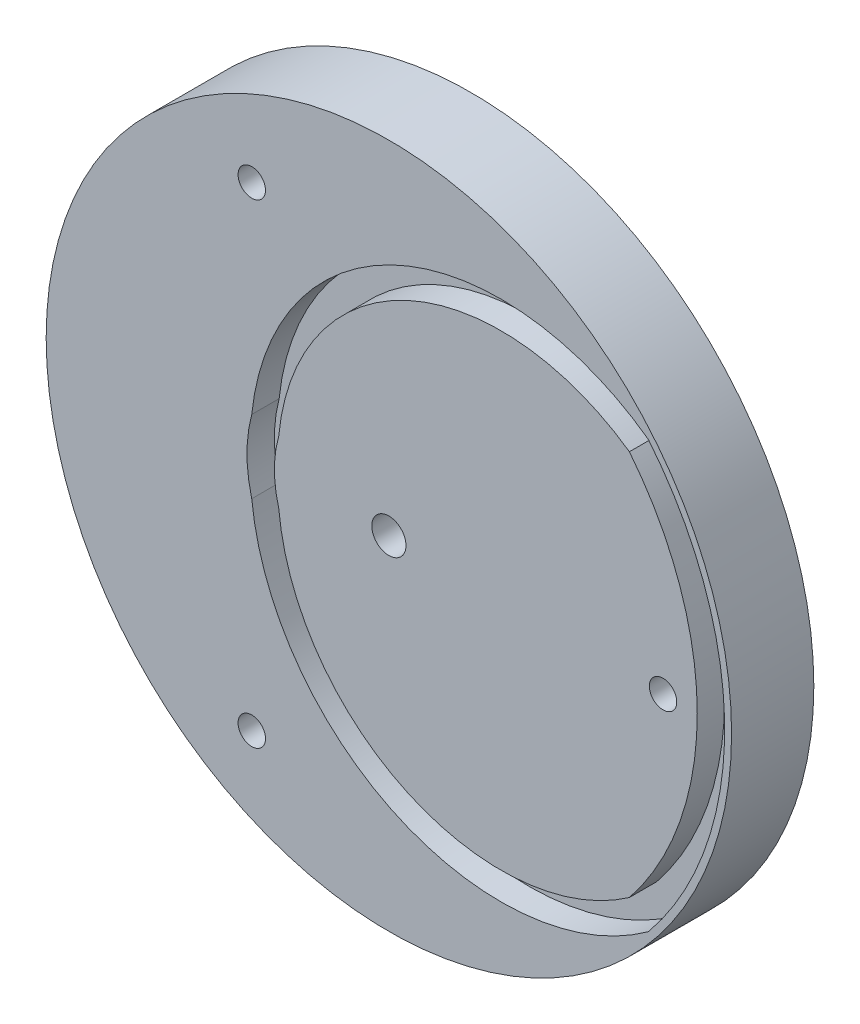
ISO-10303-21;
HEADER;
FILE_DESCRIPTION(('STEP AP214'),'2;1');
FILE_NAME('part.step','',(''),(''),'','','');
FILE_SCHEMA(('AUTOMOTIVE_DESIGN { 1 0 10303 214 1 1 1 1 }'));
ENDSEC;
DATA;
#1=APPLICATION_CONTEXT('core data for automotive mechanical design processes');
#2=APPLICATION_PROTOCOL_DEFINITION('international standard','automotive_design',2000,#1);
#3=PRODUCT_CONTEXT('',#1,'mechanical');
#4=PRODUCT('Part','Part','',(#3));
#5=PRODUCT_RELATED_PRODUCT_CATEGORY('part','',(#4));
#6=PRODUCT_DEFINITION_FORMATION('','',#4);
#7=PRODUCT_DEFINITION_CONTEXT('part definition',#1,'design');
#8=PRODUCT_DEFINITION('design','',#6,#7);
#9=PRODUCT_DEFINITION_SHAPE('','',#8);
#10=(LENGTH_UNIT() NAMED_UNIT(*) SI_UNIT(.MILLI.,.METRE.));
#11=(NAMED_UNIT(*) PLANE_ANGLE_UNIT() SI_UNIT($,.RADIAN.));
#12=(NAMED_UNIT(*) SI_UNIT($,.STERADIAN.) SOLID_ANGLE_UNIT());
#13=UNCERTAINTY_MEASURE_WITH_UNIT(LENGTH_MEASURE(1.E-05),#10,'distance_accuracy_value','');
#14=(GEOMETRIC_REPRESENTATION_CONTEXT(3) GLOBAL_UNCERTAINTY_ASSIGNED_CONTEXT((#13)) GLOBAL_UNIT_ASSIGNED_CONTEXT((#10,
#11,#12)) REPRESENTATION_CONTEXT('',''));
#15=CARTESIAN_POINT('',(0.,0.,0.));
#16=DIRECTION('',(0.,0.,1.));
#17=DIRECTION('',(1.,0.,0.));
#18=AXIS2_PLACEMENT_3D('',#15,#16,#17);
#19=CARTESIAN_POINT('',(0.,0.,0.));
#20=DIRECTION('',(0.,0.,1.));
#21=DIRECTION('',(1.,0.,0.));
#22=AXIS2_PLACEMENT_3D('',#19,#20,#21);
#23=PLANE('',#22);
#24=CARTESIAN_POINT('',(63.5,0.,0.));
#25=DIRECTION('',(0.,0.,1.));
#26=DIRECTION('',(1.,0.,0.));
#27=AXIS2_PLACEMENT_3D('',#24,#25,#26);
#28=CIRCLE('',#27,3.175);
#29=CARTESIAN_POINT('',(66.675,0.,0.));
#30=VERTEX_POINT('',#29);
#31=EDGE_CURVE('E271',#30,#30,#28,.T.);
#32=ORIENTED_EDGE('',*,*,#31,.F.);
#33=EDGE_LOOP('',(#32));
#34=FACE_BOUND('',#33,.T.);
#35=CARTESIAN_POINT('',(0.,0.,0.));
#36=DIRECTION('',(0.,0.,1.));
#37=DIRECTION('',(1.,0.,0.));
#38=AXIS2_PLACEMENT_3D('',#35,#36,#37);
#39=CIRCLE('',#38,3.9624);
#40=CARTESIAN_POINT('',(3.9624,0.,0.));
#41=VERTEX_POINT('',#40);
#42=EDGE_CURVE('E277',#41,#41,#39,.T.);
#43=ORIENTED_EDGE('',*,*,#42,.F.);
#44=EDGE_LOOP('',(#43));
#45=FACE_BOUND('',#44,.T.);
#46=CARTESIAN_POINT('',(0.,0.,0.));
#47=DIRECTION('',(0.,0.,1.));
#48=DIRECTION('',(1.,0.,0.));
#49=AXIS2_PLACEMENT_3D('',#46,#47,#48);
#50=CIRCLE('',#49,26.5182738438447);
#51=CARTESIAN_POINT('',(-25.4973153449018,7.28736974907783,0.));
#52=VERTEX_POINT('',#51);
#53=CARTESIAN_POINT('',(-25.4973153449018,-7.28736974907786,0.));
#54=VERTEX_POINT('',#53);
#55=EDGE_CURVE('E68',#52,#54,#50,.T.);
#56=ORIENTED_EDGE('',*,*,#55,.T.);
#57=CARTESIAN_POINT('',(25.9656012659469,-2.42204576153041,0.));
#58=DIRECTION('',(0.,0.,-1.));
#59=DIRECTION('',(-1.,0.,0.));
#60=AXIS2_PLACEMENT_3D('',#57,#58,#59);
#61=CIRCLE('',#60,51.6923898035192);
#62=CARTESIAN_POINT('',(55.7057618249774,-44.702372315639,0.));
#63=VERTEX_POINT('',#62);
#64=EDGE_CURVE('E140',#63,#54,#61,.T.);
#65=ORIENTED_EDGE('',*,*,#64,.F.);
#66=CARTESIAN_POINT('',(0.,0.,0.));
#67=DIRECTION('',(0.,0.,-1.));
#68=DIRECTION('',(-1.,0.,0.));
#69=AXIS2_PLACEMENT_3D('',#66,#67,#68);
#70=CIRCLE('',#69,71.4243235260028);
#71=CARTESIAN_POINT('',(55.7057618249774,44.7023723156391,0.));
#72=VERTEX_POINT('',#71);
#73=EDGE_CURVE('E123',#72,#63,#70,.T.);
#74=ORIENTED_EDGE('',*,*,#73,.F.);
#75=CARTESIAN_POINT('',(25.9656012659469,2.42204576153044,0.));
#76=DIRECTION('',(0.,0.,1.));
#77=DIRECTION('',(1.,0.,0.));
#78=AXIS2_PLACEMENT_3D('',#75,#76,#77);
#79=CIRCLE('',#78,51.6923898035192);
#80=EDGE_CURVE('E93',#72,#52,#79,.T.);
#81=ORIENTED_EDGE('',*,*,#80,.T.);
#82=EDGE_LOOP('',(#56,#65,#74,#81));
#83=FACE_BOUND('',#82,.T.);
#84=ADVANCED_FACE('F35',(#34,#45,#83),#23,.T.);
#85=CARTESIAN_POINT('',(-31.7499999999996,-54.9926131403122,0.));
#86=DIRECTION('',(0.,0.,1.));
#87=DIRECTION('',(-0.499999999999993,-0.866025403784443,0.));
#88=AXIS2_PLACEMENT_3D('',#85,#86,#87);
#89=CIRCLE('',#88,3.175);
#90=CARTESIAN_POINT('',(-33.3374999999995,-57.7422437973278,0.));
#91=VERTEX_POINT('',#90);
#92=EDGE_CURVE('E261',#91,#91,#89,.T.);
#93=ORIENTED_EDGE('',*,*,#92,.F.);
#94=EDGE_LOOP('',(#93));
#95=FACE_BOUND('',#94,.T.);
#96=CARTESIAN_POINT('',(-31.7500000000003,54.9926131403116,0.));
#97=DIRECTION('',(0.,0.,1.));
#98=DIRECTION('',(-0.500000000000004,0.866025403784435,0.));
#99=AXIS2_PLACEMENT_3D('',#96,#97,#98);
#100=CIRCLE('',#99,3.175);
#101=CARTESIAN_POINT('',(-33.3375000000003,57.7422437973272,0.));
#102=VERTEX_POINT('',#101);
#103=EDGE_CURVE('E263',#102,#102,#100,.T.);
#104=ORIENTED_EDGE('',*,*,#103,.F.);
#105=EDGE_LOOP('',(#104));
#106=FACE_BOUND('',#105,.T.);
#107=CARTESIAN_POINT('',(25.9656012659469,-2.42204576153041,0.));
#108=DIRECTION('',(0.,0.,-1.));
#109=DIRECTION('',(-1.,0.,0.));
#110=AXIS2_PLACEMENT_3D('',#107,#108,#109);
#111=CIRCLE('',#110,58.042300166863);
#112=CARTESIAN_POINT('',(60.0961989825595,-49.3689403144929,0.));
#113=VERTEX_POINT('',#112);
#114=CARTESIAN_POINT('',(-31.76258047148,-8.45243894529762,0.));
#115=VERTEX_POINT('',#114);
#116=EDGE_CURVE('E148',#113,#115,#111,.T.);
#117=ORIENTED_EDGE('',*,*,#116,.T.);
#118=CARTESIAN_POINT('',(0.,0.,0.));
#119=DIRECTION('',(0.,0.,1.));
#120=DIRECTION('',(1.,0.,0.));
#121=AXIS2_PLACEMENT_3D('',#118,#119,#120);
#122=CIRCLE('',#121,32.8679972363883);
#123=CARTESIAN_POINT('',(-31.7625804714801,8.45243894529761,0.));
#124=VERTEX_POINT('',#123);
#125=EDGE_CURVE('E187',#124,#115,#122,.T.);
#126=ORIENTED_EDGE('',*,*,#125,.F.);
#127=CARTESIAN_POINT('',(25.9656012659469,2.42204576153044,0.));
#128=DIRECTION('',(0.,0.,1.));
#129=DIRECTION('',(1.,0.,0.));
#130=AXIS2_PLACEMENT_3D('',#127,#128,#129);
#131=CIRCLE('',#130,58.042300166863);
#132=CARTESIAN_POINT('',(60.0961989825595,49.368940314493,0.));
#133=VERTEX_POINT('',#132);
#134=EDGE_CURVE('E168',#133,#124,#131,.T.);
#135=ORIENTED_EDGE('',*,*,#134,.F.);
#136=CARTESIAN_POINT('',(0.,0.,0.));
#137=DIRECTION('',(0.,0.,-1.));
#138=DIRECTION('',(-1.,0.,0.));
#139=AXIS2_PLACEMENT_3D('',#136,#137,#138);
#140=CIRCLE('',#139,77.7743235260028);
#141=EDGE_CURVE('E170',#133,#113,#140,.T.);
#142=ORIENTED_EDGE('',*,*,#141,.T.);
#143=EDGE_LOOP('',(#117,#126,#135,#142));
#144=FACE_BOUND('',#143,.T.);
#145=CARTESIAN_POINT('',(0.,0.,0.));
#146=DIRECTION('',(0.,0.,1.));
#147=DIRECTION('',(1.,0.,0.));
#148=AXIS2_PLACEMENT_3D('',#145,#146,#147);
#149=CIRCLE('',#148,79.375);
#150=CARTESIAN_POINT('',(79.3750000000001,0.,0.));
#151=VERTEX_POINT('',#150);
#152=EDGE_CURVE('E44',#151,#151,#149,.T.);
#153=ORIENTED_EDGE('',*,*,#152,.T.);
#154=EDGE_LOOP('',(#153));
#155=FACE_BOUND('',#154,.T.);
#156=ADVANCED_FACE('F192',(#95,#106,#144,#155),#23,.T.);
#157=CARTESIAN_POINT('',(0.,0.,-19.05));
#158=DIRECTION('',(0.,0.,1.));
#159=DIRECTION('',(1.,0.,0.));
#160=AXIS2_PLACEMENT_3D('',#157,#158,#159);
#161=CYLINDRICAL_SURFACE('',#160,79.375);
#162=CARTESIAN_POINT('',(0.,0.,-19.05));
#163=DIRECTION('',(0.,0.,1.));
#164=DIRECTION('',(1.,0.,0.));
#165=AXIS2_PLACEMENT_3D('',#162,#163,#164);
#166=CIRCLE('',#165,79.375);
#167=CARTESIAN_POINT('',(79.3750000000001,0.,-19.05));
#168=VERTEX_POINT('',#167);
#169=EDGE_CURVE('E11',#168,#168,#166,.T.);
#170=ORIENTED_EDGE('',*,*,#169,.T.);
#171=EDGE_LOOP('',(#170));
#172=FACE_BOUND('',#171,.T.);
#173=ORIENTED_EDGE('',*,*,#152,.F.);
#174=EDGE_LOOP('',(#173));
#175=FACE_BOUND('',#174,.T.);
#176=ADVANCED_FACE('F37',(#172,#175),#161,.T.);
#177=CARTESIAN_POINT('',(0.,0.,-19.05));
#178=DIRECTION('',(0.,0.,1.));
#179=DIRECTION('',(1.,0.,0.));
#180=AXIS2_PLACEMENT_3D('',#177,#178,#179);
#181=PLANE('',#180);
#182=CARTESIAN_POINT('',(-31.7499999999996,-54.9926131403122,-19.05));
#183=DIRECTION('',(0.,0.,1.));
#184=DIRECTION('',(-0.499999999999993,-0.866025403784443,0.));
#185=AXIS2_PLACEMENT_3D('',#182,#183,#184);
#186=CIRCLE('',#185,3.175);
#187=CARTESIAN_POINT('',(-33.3374999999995,-57.7422437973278,-19.05));
#188=VERTEX_POINT('',#187);
#189=EDGE_CURVE('E258',#188,#188,#186,.T.);
#190=ORIENTED_EDGE('',*,*,#189,.T.);
#191=EDGE_LOOP('',(#190));
#192=FACE_BOUND('',#191,.T.);
#193=CARTESIAN_POINT('',(-31.7500000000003,54.9926131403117,-19.05));
#194=DIRECTION('',(0.,0.,1.));
#195=DIRECTION('',(-0.500000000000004,0.866025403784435,0.));
#196=AXIS2_PLACEMENT_3D('',#193,#194,#195);
#197=CIRCLE('',#196,3.175);
#198=CARTESIAN_POINT('',(-33.3375000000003,57.7422437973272,-19.05));
#199=VERTEX_POINT('',#198);
#200=EDGE_CURVE('E268',#199,#199,#197,.T.);
#201=ORIENTED_EDGE('',*,*,#200,.T.);
#202=EDGE_LOOP('',(#201));
#203=FACE_BOUND('',#202,.T.);
#204=CARTESIAN_POINT('',(63.5,0.,-19.05));
#205=DIRECTION('',(0.,0.,1.));
#206=DIRECTION('',(1.,0.,0.));
#207=AXIS2_PLACEMENT_3D('',#204,#205,#206);
#208=CIRCLE('',#207,3.175);
#209=CARTESIAN_POINT('',(66.675,0.,-19.05));
#210=VERTEX_POINT('',#209);
#211=EDGE_CURVE('E274',#210,#210,#208,.T.);
#212=ORIENTED_EDGE('',*,*,#211,.T.);
#213=EDGE_LOOP('',(#212));
#214=FACE_BOUND('',#213,.T.);
#215=CARTESIAN_POINT('',(0.,0.,-19.05));
#216=DIRECTION('',(0.,0.,1.));
#217=DIRECTION('',(1.,0.,0.));
#218=AXIS2_PLACEMENT_3D('',#215,#216,#217);
#219=CIRCLE('',#218,3.9624);
#220=CARTESIAN_POINT('',(3.9624,0.,-19.05));
#221=VERTEX_POINT('',#220);
#222=EDGE_CURVE('E145',#221,#221,#219,.T.);
#223=ORIENTED_EDGE('',*,*,#222,.T.);
#224=EDGE_LOOP('',(#223));
#225=FACE_BOUND('',#224,.T.);
#226=ORIENTED_EDGE('',*,*,#169,.F.);
#227=EDGE_LOOP('',(#226));
#228=FACE_BOUND('',#227,.T.);
#229=ADVANCED_FACE('F195',(#192,#203,#214,#225,#228),#181,.F.);
#230=CARTESIAN_POINT('',(0.,0.,0.));
#231=DIRECTION('',(0.,0.,1.));
#232=DIRECTION('',(1.,0.,0.));
#233=AXIS2_PLACEMENT_3D('',#230,#231,#232);
#234=CYLINDRICAL_SURFACE('',#233,26.5182738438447);
#235=CARTESIAN_POINT('',(0.,0.,-6.35));
#236=DIRECTION('',(0.,0.,1.));
#237=DIRECTION('',(1.,0.,0.));
#238=AXIS2_PLACEMENT_3D('',#235,#236,#237);
#239=CIRCLE('',#238,26.5182738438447);
#240=CARTESIAN_POINT('',(-25.4973153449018,7.28736974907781,-6.34999999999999));
#241=VERTEX_POINT('',#240);
#242=CARTESIAN_POINT('',(-25.4973153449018,-7.28736974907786,-6.35));
#243=VERTEX_POINT('',#242);
#244=EDGE_CURVE('E184',#241,#243,#239,.T.);
#245=ORIENTED_EDGE('',*,*,#244,.T.);
#246=DIRECTION('',(0.,0.,-1.));
#247=VECTOR('',#246,1.);
#248=CARTESIAN_POINT('',(-25.4973153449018,-7.28736974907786,0.));
#249=LINE('',#248,#247);
#250=EDGE_CURVE('E133',#54,#243,#249,.T.);
#251=ORIENTED_EDGE('',*,*,#250,.F.);
#252=ORIENTED_EDGE('',*,*,#55,.F.);
#253=DIRECTION('',(0.,0.,1.));
#254=VECTOR('',#253,1.);
#255=CARTESIAN_POINT('',(-25.4973153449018,7.28736974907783,0.));
#256=LINE('',#255,#254);
#257=EDGE_CURVE('E166',#52,#241,#256,.F.);
#258=ORIENTED_EDGE('',*,*,#257,.T.);
#259=EDGE_LOOP('',(#245,#251,#252,#258));
#260=FACE_BOUND('',#259,.T.);
#261=ADVANCED_FACE('F197',(#260),#234,.T.);
#262=CARTESIAN_POINT('',(0.,0.,0.));
#263=DIRECTION('',(0.,0.,1.));
#264=DIRECTION('',(1.,0.,0.));
#265=AXIS2_PLACEMENT_3D('',#262,#263,#264);
#266=CYLINDRICAL_SURFACE('',#265,32.8679972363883);
#267=ORIENTED_EDGE('',*,*,#125,.T.);
#268=DIRECTION('',(0.,0.,-1.));
#269=VECTOR('',#268,1.);
#270=CARTESIAN_POINT('',(-31.76258047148,-8.45243894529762,0.));
#271=LINE('',#270,#269);
#272=CARTESIAN_POINT('',(-31.7625804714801,-8.45243894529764,-6.35));
#273=VERTEX_POINT('',#272);
#274=EDGE_CURVE('E164',#273,#115,#271,.F.);
#275=ORIENTED_EDGE('',*,*,#274,.F.);
#276=CARTESIAN_POINT('',(0.,0.,-6.35));
#277=DIRECTION('',(0.,0.,1.));
#278=DIRECTION('',(1.,0.,0.));
#279=AXIS2_PLACEMENT_3D('',#276,#277,#278);
#280=CIRCLE('',#279,32.8679972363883);
#281=CARTESIAN_POINT('',(-31.7625804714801,8.4524389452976,-6.35));
#282=VERTEX_POINT('',#281);
#283=EDGE_CURVE('E57',#282,#273,#280,.T.);
#284=ORIENTED_EDGE('',*,*,#283,.F.);
#285=DIRECTION('',(0.,0.,1.));
#286=VECTOR('',#285,1.);
#287=CARTESIAN_POINT('',(-31.76258047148,8.45243894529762,0.));
#288=LINE('',#287,#286);
#289=EDGE_CURVE('E51',#282,#124,#288,.T.);
#290=ORIENTED_EDGE('',*,*,#289,.T.);
#291=EDGE_LOOP('',(#267,#275,#284,#290));
#292=FACE_BOUND('',#291,.T.);
#293=ADVANCED_FACE('F206',(#292),#266,.F.);
#294=CARTESIAN_POINT('',(25.9656012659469,2.42204576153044,0.));
#295=DIRECTION('',(0.,0.,1.));
#296=DIRECTION('',(1.,0.,0.));
#297=AXIS2_PLACEMENT_3D('',#294,#295,#296);
#298=CYLINDRICAL_SURFACE('',#297,51.6923898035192);
#299=ORIENTED_EDGE('',*,*,#80,.F.);
#300=DIRECTION('',(0.,0.,-1.));
#301=VECTOR('',#300,1.);
#302=CARTESIAN_POINT('',(55.7057618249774,44.7023723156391,0.));
#303=LINE('',#302,#301);
#304=CARTESIAN_POINT('',(55.7057618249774,44.7023723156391,-6.35));
#305=VERTEX_POINT('',#304);
#306=EDGE_CURVE('E128',#305,#72,#303,.F.);
#307=ORIENTED_EDGE('',*,*,#306,.F.);
#308=CARTESIAN_POINT('',(25.9656012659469,2.42204576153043,-6.34999999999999));
#309=DIRECTION('',(0.,0.,1.));
#310=DIRECTION('',(1.,0.,0.));
#311=AXIS2_PLACEMENT_3D('',#308,#309,#310);
#312=CIRCLE('',#311,51.6923898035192);
#313=EDGE_CURVE('E87',#305,#241,#312,.T.);
#314=ORIENTED_EDGE('',*,*,#313,.T.);
#315=ORIENTED_EDGE('',*,*,#257,.F.);
#316=EDGE_LOOP('',(#299,#307,#314,#315));
#317=FACE_BOUND('',#316,.T.);
#318=ADVANCED_FACE('F216',(#317),#298,.T.);
#319=CARTESIAN_POINT('',(25.9656012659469,2.42204576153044,0.));
#320=DIRECTION('',(0.,0.,1.));
#321=DIRECTION('',(1.,0.,0.));
#322=AXIS2_PLACEMENT_3D('',#319,#320,#321);
#323=CYLINDRICAL_SURFACE('',#322,58.042300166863);
#324=CARTESIAN_POINT('',(25.9656012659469,2.42204576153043,-6.34999999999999));
#325=DIRECTION('',(0.,0.,1.));
#326=DIRECTION('',(1.,0.,0.));
#327=AXIS2_PLACEMENT_3D('',#324,#325,#326);
#328=CIRCLE('',#327,58.042300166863);
#329=CARTESIAN_POINT('',(60.0961989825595,49.368940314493,-6.34999999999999));
#330=VERTEX_POINT('',#329);
#331=EDGE_CURVE('E180',#330,#282,#328,.T.);
#332=ORIENTED_EDGE('',*,*,#331,.F.);
#333=DIRECTION('',(0.,0.,-1.));
#334=VECTOR('',#333,1.);
#335=CARTESIAN_POINT('',(60.0961989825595,49.368940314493,0.));
#336=LINE('',#335,#334);
#337=EDGE_CURVE('E76',#133,#330,#336,.T.);
#338=ORIENTED_EDGE('',*,*,#337,.F.);
#339=ORIENTED_EDGE('',*,*,#134,.T.);
#340=ORIENTED_EDGE('',*,*,#289,.F.);
#341=EDGE_LOOP('',(#332,#338,#339,#340));
#342=FACE_BOUND('',#341,.T.);
#343=ADVANCED_FACE('F218',(#342),#323,.F.);
#344=CARTESIAN_POINT('',(0.,0.,0.));
#345=DIRECTION('',(0.,0.,-1.));
#346=DIRECTION('',(-1.,0.,0.));
#347=AXIS2_PLACEMENT_3D('',#344,#345,#346);
#348=CYLINDRICAL_SURFACE('',#347,71.4243235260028);
#349=ORIENTED_EDGE('',*,*,#306,.T.);
#350=ORIENTED_EDGE('',*,*,#73,.T.);
#351=DIRECTION('',(0.,0.,1.));
#352=VECTOR('',#351,1.);
#353=CARTESIAN_POINT('',(55.7057618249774,-44.702372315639,0.));
#354=LINE('',#353,#352);
#355=CARTESIAN_POINT('',(55.7057618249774,-44.702372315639,-6.34999999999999));
#356=VERTEX_POINT('',#355);
#357=EDGE_CURVE('E127',#356,#63,#354,.T.);
#358=ORIENTED_EDGE('',*,*,#357,.F.);
#359=CARTESIAN_POINT('',(0.,0.,-6.35));
#360=DIRECTION('',(0.,0.,-1.));
#361=DIRECTION('',(-1.,0.,0.));
#362=AXIS2_PLACEMENT_3D('',#359,#360,#361);
#363=CIRCLE('',#362,71.4243235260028);
#364=EDGE_CURVE('E132',#305,#356,#363,.T.);
#365=ORIENTED_EDGE('',*,*,#364,.F.);
#366=EDGE_LOOP('',(#349,#350,#358,#365));
#367=FACE_BOUND('',#366,.T.);
#368=ADVANCED_FACE('F125',(#367),#348,.T.);
#369=CARTESIAN_POINT('',(59.9238254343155,49.5780248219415,-6.35));
#370=DIRECTION('',(0.,0.,1.));
#371=DIRECTION('',(1.,0.,0.));
#372=AXIS2_PLACEMENT_3D('',#369,#370,#371);
#373=PLANE('',#372);
#374=ORIENTED_EDGE('',*,*,#364,.T.);
#375=CARTESIAN_POINT('',(25.9656012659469,-2.42204576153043,-6.35));
#376=DIRECTION('',(0.,0.,-1.));
#377=DIRECTION('',(-1.,0.,0.));
#378=AXIS2_PLACEMENT_3D('',#375,#376,#377);
#379=CIRCLE('',#378,51.6923898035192);
#380=EDGE_CURVE('E142',#356,#243,#379,.T.);
#381=ORIENTED_EDGE('',*,*,#380,.T.);
#382=ORIENTED_EDGE('',*,*,#244,.F.);
#383=ORIENTED_EDGE('',*,*,#313,.F.);
#384=EDGE_LOOP('',(#374,#381,#382,#383));
#385=FACE_BOUND('',#384,.T.);
#386=CARTESIAN_POINT('',(25.9656012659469,-2.42204576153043,-6.35));
#387=DIRECTION('',(0.,0.,-1.));
#388=DIRECTION('',(-1.,0.,0.));
#389=AXIS2_PLACEMENT_3D('',#386,#387,#388);
#390=CIRCLE('',#389,58.042300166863);
#391=CARTESIAN_POINT('',(60.0961989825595,-49.3689403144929,-6.35));
#392=VERTEX_POINT('',#391);
#393=EDGE_CURVE('E153',#392,#273,#390,.T.);
#394=ORIENTED_EDGE('',*,*,#393,.F.);
#395=CARTESIAN_POINT('',(0.,0.,-6.35));
#396=DIRECTION('',(0.,0.,-1.));
#397=DIRECTION('',(-1.,0.,0.));
#398=AXIS2_PLACEMENT_3D('',#395,#396,#397);
#399=CIRCLE('',#398,77.7743235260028);
#400=EDGE_CURVE('E174',#330,#392,#399,.T.);
#401=ORIENTED_EDGE('',*,*,#400,.F.);
#402=ORIENTED_EDGE('',*,*,#331,.T.);
#403=ORIENTED_EDGE('',*,*,#283,.T.);
#404=EDGE_LOOP('',(#394,#401,#402,#403));
#405=FACE_BOUND('',#404,.T.);
#406=ADVANCED_FACE('F226',(#385,#405),#373,.T.);
#407=CARTESIAN_POINT('',(0.,0.,0.));
#408=DIRECTION('',(0.,0.,-1.));
#409=DIRECTION('',(-1.,0.,0.));
#410=AXIS2_PLACEMENT_3D('',#407,#408,#409);
#411=CYLINDRICAL_SURFACE('',#410,77.7743235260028);
#412=ORIENTED_EDGE('',*,*,#337,.T.);
#413=ORIENTED_EDGE('',*,*,#400,.T.);
#414=DIRECTION('',(0.,0.,1.));
#415=VECTOR('',#414,1.);
#416=CARTESIAN_POINT('',(60.0961989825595,-49.3689403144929,0.));
#417=LINE('',#416,#415);
#418=EDGE_CURVE('E144',#113,#392,#417,.F.);
#419=ORIENTED_EDGE('',*,*,#418,.F.);
#420=ORIENTED_EDGE('',*,*,#141,.F.);
#421=EDGE_LOOP('',(#412,#413,#419,#420));
#422=FACE_BOUND('',#421,.T.);
#423=ADVANCED_FACE('F223',(#422),#411,.F.);
#424=CARTESIAN_POINT('',(25.9656012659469,-2.42204576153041,0.));
#425=DIRECTION('',(0.,0.,-1.));
#426=DIRECTION('',(-1.,0.,0.));
#427=AXIS2_PLACEMENT_3D('',#424,#425,#426);
#428=CYLINDRICAL_SURFACE('',#427,51.6923898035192);
#429=ORIENTED_EDGE('',*,*,#250,.T.);
#430=ORIENTED_EDGE('',*,*,#380,.F.);
#431=ORIENTED_EDGE('',*,*,#357,.T.);
#432=ORIENTED_EDGE('',*,*,#64,.T.);
#433=EDGE_LOOP('',(#429,#430,#431,#432));
#434=FACE_BOUND('',#433,.T.);
#435=ADVANCED_FACE('F139',(#434),#428,.T.);
#436=CARTESIAN_POINT('',(25.9656012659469,-2.42204576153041,0.));
#437=DIRECTION('',(0.,0.,-1.));
#438=DIRECTION('',(-1.,0.,0.));
#439=AXIS2_PLACEMENT_3D('',#436,#437,#438);
#440=CYLINDRICAL_SURFACE('',#439,58.042300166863);
#441=ORIENTED_EDGE('',*,*,#274,.T.);
#442=ORIENTED_EDGE('',*,*,#116,.F.);
#443=ORIENTED_EDGE('',*,*,#418,.T.);
#444=ORIENTED_EDGE('',*,*,#393,.T.);
#445=EDGE_LOOP('',(#441,#442,#443,#444));
#446=FACE_BOUND('',#445,.T.);
#447=ADVANCED_FACE('F232',(#446),#440,.F.);
#448=CARTESIAN_POINT('',(0.,0.,-19.05));
#449=DIRECTION('',(0.,0.,1.));
#450=DIRECTION('',(1.,0.,0.));
#451=AXIS2_PLACEMENT_3D('',#448,#449,#450);
#452=CYLINDRICAL_SURFACE('',#451,3.9624);
#453=ORIENTED_EDGE('',*,*,#222,.F.);
#454=EDGE_LOOP('',(#453));
#455=FACE_BOUND('',#454,.T.);
#456=ORIENTED_EDGE('',*,*,#42,.T.);
#457=EDGE_LOOP('',(#456));
#458=FACE_BOUND('',#457,.T.);
#459=ADVANCED_FACE('F235',(#455,#458),#452,.F.);
#460=CARTESIAN_POINT('',(63.5,0.,-19.05));
#461=DIRECTION('',(0.,0.,1.));
#462=DIRECTION('',(1.,0.,0.));
#463=AXIS2_PLACEMENT_3D('',#460,#461,#462);
#464=CYLINDRICAL_SURFACE('',#463,3.175);
#465=ORIENTED_EDGE('',*,*,#211,.F.);
#466=EDGE_LOOP('',(#465));
#467=FACE_BOUND('',#466,.T.);
#468=ORIENTED_EDGE('',*,*,#31,.T.);
#469=EDGE_LOOP('',(#468));
#470=FACE_BOUND('',#469,.T.);
#471=ADVANCED_FACE('F241',(#467,#470),#464,.F.);
#472=CARTESIAN_POINT('',(-31.7500000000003,54.9926131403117,-19.05));
#473=DIRECTION('',(0.,0.,1.));
#474=DIRECTION('',(1.,0.,0.));
#475=AXIS2_PLACEMENT_3D('',#472,#473,#474);
#476=CYLINDRICAL_SURFACE('',#475,3.175);
#477=ORIENTED_EDGE('',*,*,#200,.F.);
#478=EDGE_LOOP('',(#477));
#479=FACE_BOUND('',#478,.T.);
#480=ORIENTED_EDGE('',*,*,#103,.T.);
#481=EDGE_LOOP('',(#480));
#482=FACE_BOUND('',#481,.T.);
#483=ADVANCED_FACE('F245',(#479,#482),#476,.F.);
#484=CARTESIAN_POINT('',(-31.7499999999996,-54.9926131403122,-19.05));
#485=DIRECTION('',(0.,0.,1.));
#486=DIRECTION('',(1.,0.,0.));
#487=AXIS2_PLACEMENT_3D('',#484,#485,#486);
#488=CYLINDRICAL_SURFACE('',#487,3.175);
#489=ORIENTED_EDGE('',*,*,#189,.F.);
#490=EDGE_LOOP('',(#489));
#491=FACE_BOUND('',#490,.T.);
#492=ORIENTED_EDGE('',*,*,#92,.T.);
#493=EDGE_LOOP('',(#492));
#494=FACE_BOUND('',#493,.T.);
#495=ADVANCED_FACE('F249',(#491,#494),#488,.F.);
#496=CLOSED_SHELL('',(#84,#156,#176,#229,#261,#293,#318,#343,#368,#406,#423,#435,#447,#459,#471,
#483,#495));
#497=MANIFOLD_SOLID_BREP('B2',#496);
#498=ADVANCED_BREP_SHAPE_REPRESENTATION('',(#18,#497),#14);
#499=SHAPE_DEFINITION_REPRESENTATION(#9,#498);
ENDSEC;
END-ISO-10303-21;
